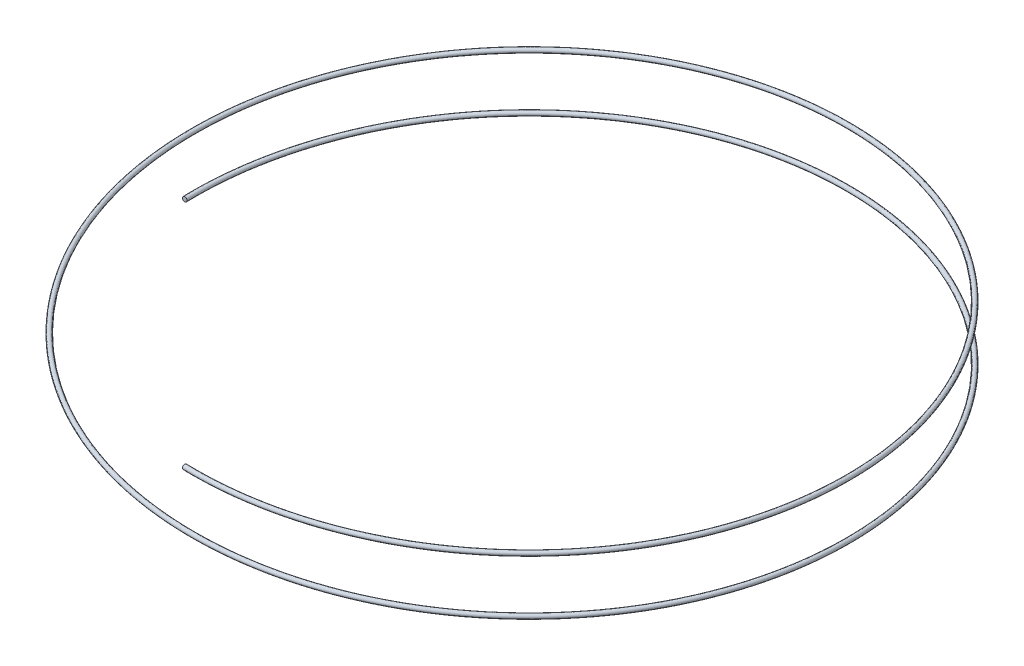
from build123d import *

# Parameters (mm, degrees)
BARRER1_PITCH       = 11
BARRER1_HEIGHT      = 19.25
BARRER1_RADIUS      = 65.953828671
BARRER1_START_ANGLE = -90
CROQUIS3_R          = 0.463460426


with BuildPart() as part:
    # Barrer1: sweep along a helix
    with BuildLine() as barrer1_path:
        add(Helix(BARRER1_PITCH, BARRER1_HEIGHT, BARRER1_RADIUS, center=(0, 0, 0), direction=(0, 1, 0), lefthand=True, mode=Mode.PRIVATE).rotate(Axis((0, 0, 0), (0, 1, 0)), BARRER1_START_ANGLE))
    # Croquis3 → Barrer1 (sweep)
    with BuildSketch(Plane.XY):
        with Locations((-65.953828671, 0)):
            Circle(CROQUIS3_R)
    sweep(path=barrer1_path.line, is_frenet=True)


solid = part.part
